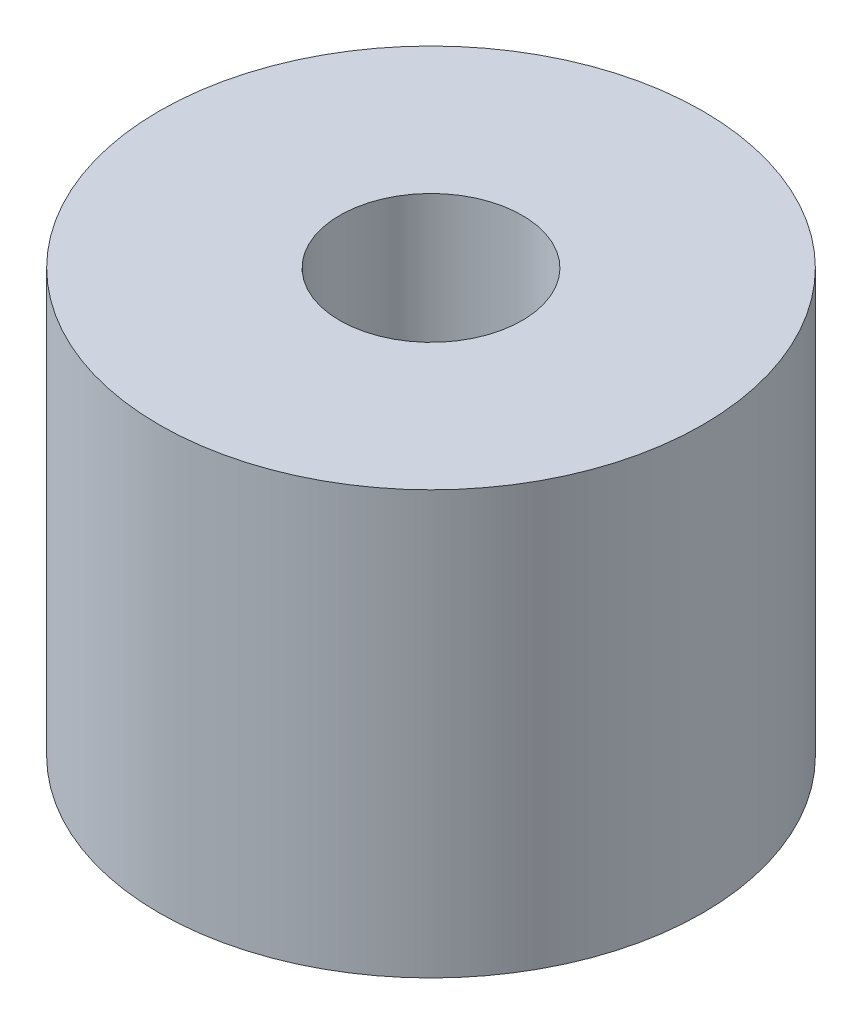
from build123d import *

# Parameters (mm, degrees)
SKETCH1_R                      = 22.5
BOSS_EXTRUDE1_DEPTH            = 35
SKETCH2_R                      = 7.55
CUT_EXTRUDE1_DEPTH             = 25
CBORE_FOR_M6_SHCS1_D           = 6.6
CBORE_FOR_M6_SHCS1_CBORE_D     = 11
CBORE_FOR_M6_SHCS1_CBORE_DEPTH = 7


with BuildPart() as part:
    # Sketch1 → Boss-Extrude1 (new body)
    with BuildSketch(Plane(origin=(0, 0, 0), x_dir=(1, 0, 0), z_dir=(0, 1, 0))):
        with Locations(Location((0, 0, 0), (0, 0, 270))):
            Circle(SKETCH1_R)
    extrude(amount=BOSS_EXTRUDE1_DEPTH)

    # Sketch2 → Cut-Extrude1 (cut)
    with BuildSketch(Plane(origin=(0, 35, 0), x_dir=(1, 0, 0), z_dir=(0, 1, 0))):
        with Locations(Location((0, 0, 0), (0, 0, 270))):
            Circle(SKETCH2_R)
    extrude(amount=-CUT_EXTRUDE1_DEPTH, mode=Mode.SUBTRACT)

    # CBORE for M6 SHCS1 (through all)
    with Locations(Plane(origin=(0, 10, 0), x_dir=(1, 0, 0), z_dir=(0, 1, 0))):
        with Locations((0, 0)):
            CounterBoreHole(CBORE_FOR_M6_SHCS1_D / 2, CBORE_FOR_M6_SHCS1_CBORE_D / 2, CBORE_FOR_M6_SHCS1_CBORE_DEPTH)


solid = part.part
